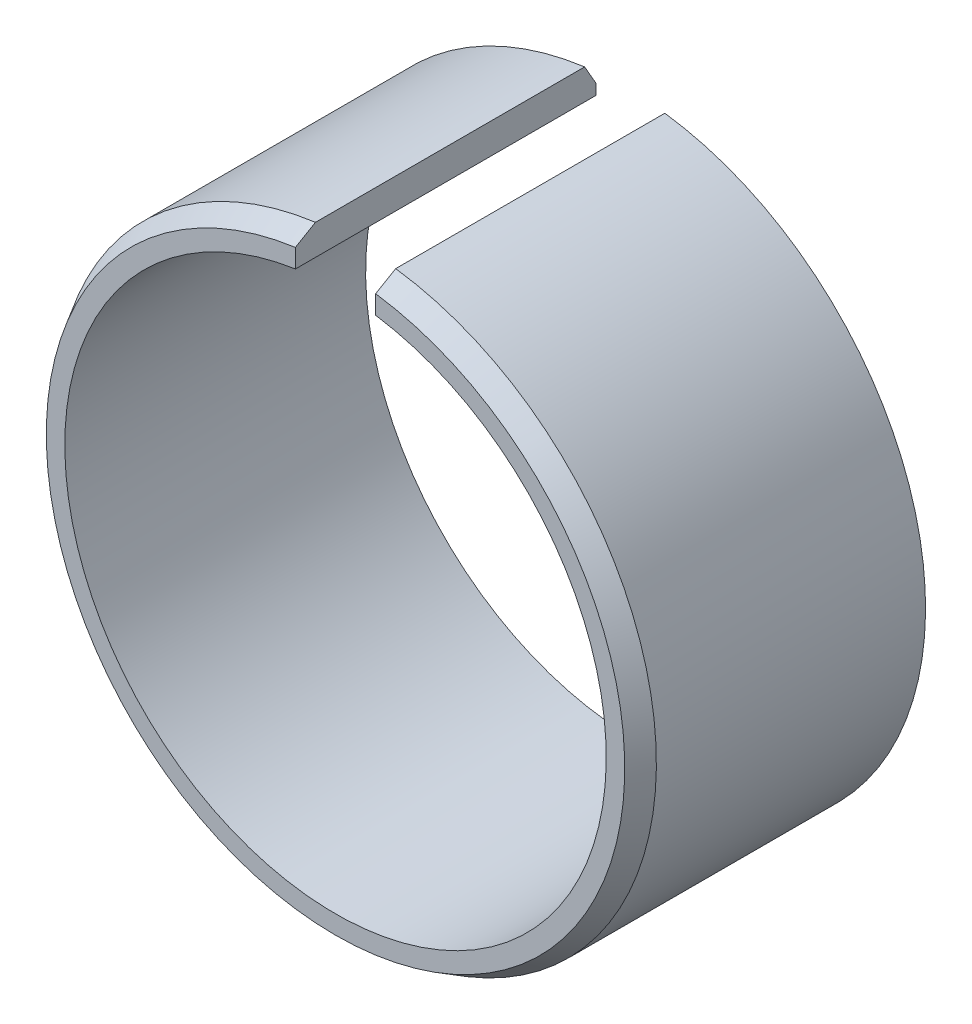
from build123d import *
from OCP.BRepFilletAPI import BRepFilletAPI_MakeChamfer

# Parameters (mm, degrees)
EXTRUSION1_DEPTH = 15
CHANFREIN1_SIZE  = 1
CHANFREIN1_SIZE2 = 0.577350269


with BuildPart() as part:
    # Esquisse1 → Extrusion1 (new body)
    with BuildSketch(Plane.XY):
        with BuildLine():
            Line((-2, 14.866068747), (-2, 13.351029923))
            ThreePointArc((-2, 13.351029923), (0, -13.5), (2, 13.351029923))
            Line((2, 13.351029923), (2, 14.866068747))
            ThreePointArc((2, 14.866068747), (0, -15), (-2, 14.866068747))
        make_face()
    extrude(amount=EXTRUSION1_DEPTH)

    # Chanfrein1: one chamfer whose edges measure the first distance from different faces: ONE call of the kernel's chamfer builder (chamfer() names one face for all edges)
    chanfrein1_edges_1 = [part.edges().sort_by_distance(p)[0] for p in [
        (0, -15, 15),
    ]]
    chanfrein1_side_1 = [part.faces().sort_by_distance(p)[0] for p in [
        (0, -15, 7.5),
    ]]
    chanfrein1_edges_2 = [part.edges().sort_by_distance(p)[0] for p in [
        (0, -15, 0),
    ]]
    chanfrein1_side_2 = [part.faces().sort_by_distance(p)[0] for p in [
        (2.423318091, 14.108549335, 0),
    ]]
    chanfrein1 = BRepFilletAPI_MakeChamfer(part.part.solid().wrapped)
    for e in chanfrein1_edges_1:
        chanfrein1.Add(CHANFREIN1_SIZE, CHANFREIN1_SIZE2, e.wrapped, chanfrein1_side_1[0].wrapped)  # the first distance lies on this face
    for e in chanfrein1_edges_2:
        chanfrein1.Add(CHANFREIN1_SIZE, CHANFREIN1_SIZE2, e.wrapped, chanfrein1_side_2[0].wrapped)  # the first distance lies on this face
    add(Compound.cast(chanfrein1.Shape()), mode=Mode.REPLACE)


solid = part.part
